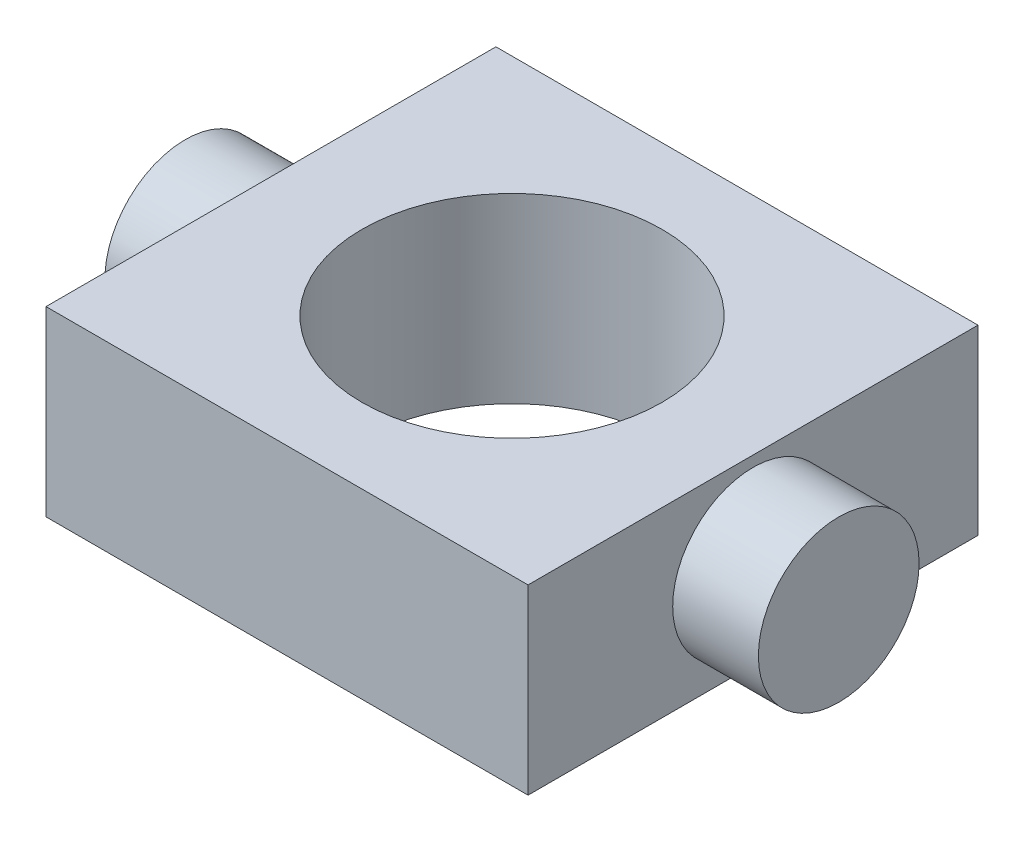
from build123d import *

# Parameters (mm, degrees)
ESQUISSE1_W             = 45
ESQUISSE1_H             = 17
BASE_EXTRUSION_DEPTH    = 42
ESQUISSE2_R             = 14
ENL_V_MAT_EXTRU_1_DEPTH = 64.859220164
ESQUISSE3_R             = 7.5
BOSS_EXTRU_1_DEPTH      = 8


with BuildPart() as part:
    # Esquisse1 → Base-Extrusion (new body)
    with BuildSketch(Plane.XY):
        with Locations((22.5, 8.5)):
            Rectangle(ESQUISSE1_W, ESQUISSE1_H)
    extrude(amount=BASE_EXTRUSION_DEPTH)

    # Esquisse2 → Enl_v. mat.-Extru.1 (cut, through all)
    with BuildSketch(Plane(origin=(0, 17, 0), x_dir=(-1, 0, 0), z_dir=(0, 1, 0))):
        with Locations(Location((-22.5, 21, 0), (0, 0, 90))):
            Circle(ESQUISSE2_R)
    extrude(amount=-ENL_V_MAT_EXTRU_1_DEPTH, mode=Mode.SUBTRACT)

    # Esquisse3 → Boss.-Extru.1 (add)
    with BuildSketch(Plane(origin=(45, 0, 0), x_dir=(0, 0, -1), z_dir=(1, 0, 0))):
        with Locations(Location((-21, 8.5, 0), (0, 0, 180))):
            Circle(ESQUISSE3_R)
    boss_extru_1 = extrude(amount=BOSS_EXTRU_1_DEPTH)

    # Sym_trie1: Boss.-Extru.1 across plane
    add(boss_extru_1.mirror(Plane(origin=(22.5, 0, 0), x_dir=(0, 0, 1), z_dir=(1, 0, 0))))


solid = part.part
